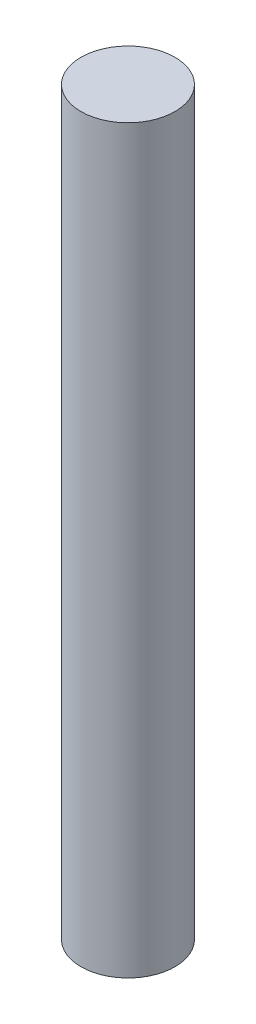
from build123d import *

# Parameters (mm, degrees)
SKETCH1_R           = 6.35
BOSS_EXTRUDE1_DEPTH = 100


with BuildPart() as part:
    # Sketch1 → Boss-Extrude1 (new body)
    with BuildSketch(Plane(origin=(0, 0, 0), x_dir=(1, 0, 0), z_dir=(0, 1, 0))):
        with Locations(Location((0, 0, 0), (0, 0, 270))):
            Circle(SKETCH1_R)
    extrude(amount=BOSS_EXTRUDE1_DEPTH)


solid = part.part
